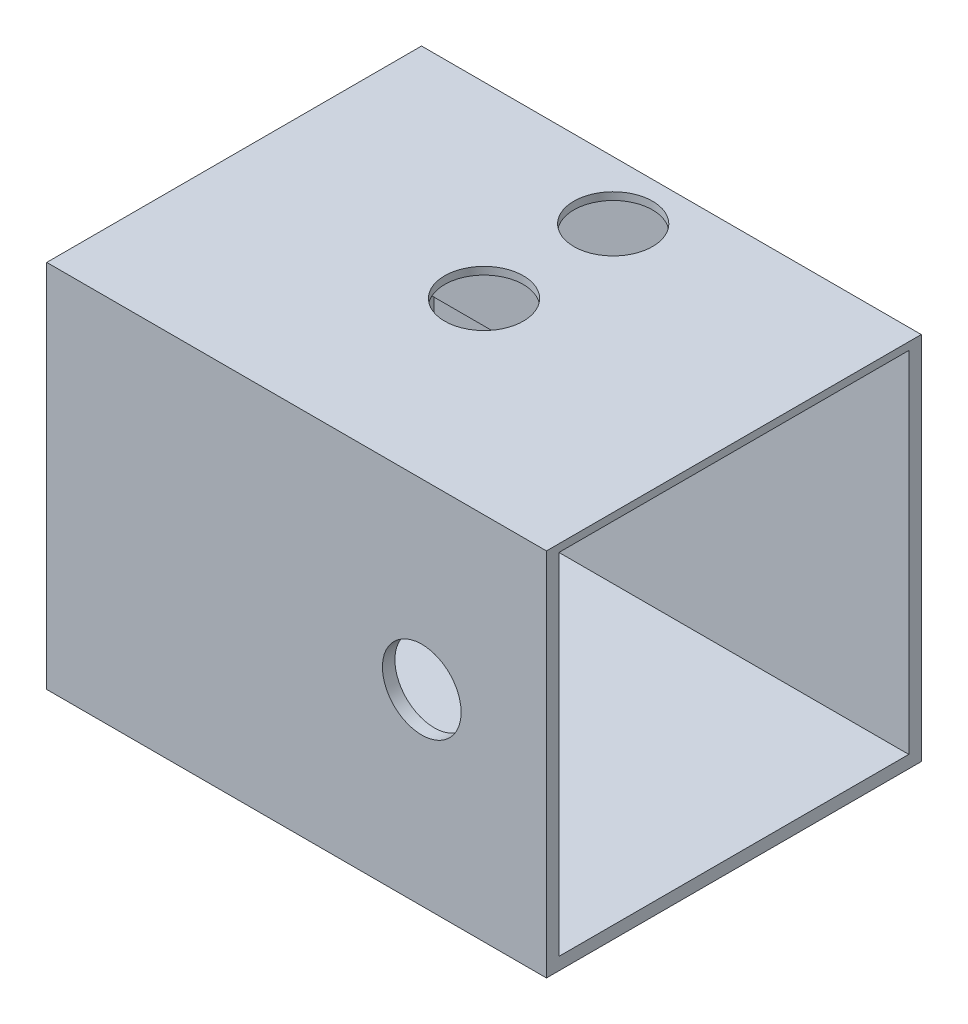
ISO-10303-21;
HEADER;
FILE_DESCRIPTION(('STEP AP214'),'2;1');
FILE_NAME('part.step','',(''),(''),'','','');
FILE_SCHEMA(('AUTOMOTIVE_DESIGN { 1 0 10303 214 1 1 1 1 }'));
ENDSEC;
DATA;
#1=APPLICATION_CONTEXT('core data for automotive mechanical design processes');
#2=APPLICATION_PROTOCOL_DEFINITION('international standard','automotive_design',2000,#1);
#3=PRODUCT_CONTEXT('',#1,'mechanical');
#4=PRODUCT('Part','Part','',(#3));
#5=PRODUCT_RELATED_PRODUCT_CATEGORY('part','',(#4));
#6=PRODUCT_DEFINITION_FORMATION('','',#4);
#7=PRODUCT_DEFINITION_CONTEXT('part definition',#1,'design');
#8=PRODUCT_DEFINITION('design','',#6,#7);
#9=PRODUCT_DEFINITION_SHAPE('','',#8);
#10=(LENGTH_UNIT() NAMED_UNIT(*) SI_UNIT(.MILLI.,.METRE.));
#11=(NAMED_UNIT(*) PLANE_ANGLE_UNIT() SI_UNIT($,.RADIAN.));
#12=(NAMED_UNIT(*) SI_UNIT($,.STERADIAN.) SOLID_ANGLE_UNIT());
#13=UNCERTAINTY_MEASURE_WITH_UNIT(LENGTH_MEASURE(1.E-05),#10,'distance_accuracy_value','');
#14=(GEOMETRIC_REPRESENTATION_CONTEXT(3) GLOBAL_UNCERTAINTY_ASSIGNED_CONTEXT((#13)) GLOBAL_UNIT_ASSIGNED_CONTEXT((#10,
#11,#12)) REPRESENTATION_CONTEXT('',''));
#15=CARTESIAN_POINT('',(0.,0.,0.));
#16=DIRECTION('',(0.,0.,1.));
#17=DIRECTION('',(1.,0.,0.));
#18=AXIS2_PLACEMENT_3D('',#15,#16,#17);
#19=CARTESIAN_POINT('',(25.4,19.05,38.1));
#20=DIRECTION('',(-1.,0.,0.));
#21=DIRECTION('',(0.,-1.,0.));
#22=AXIS2_PLACEMENT_3D('',#19,#20,#21);
#23=PLANE('',#22);
#24=DIRECTION('',(0.,-1.,0.));
#25=VECTOR('',#24,1.);
#26=CARTESIAN_POINT('',(25.4,0.,1.27));
#27=LINE('',#26,#25);
#28=CARTESIAN_POINT('',(25.4,17.78,1.27));
#29=VERTEX_POINT('',#28);
#30=CARTESIAN_POINT('',(25.4,-17.78,1.27));
#31=VERTEX_POINT('',#30);
#32=EDGE_CURVE('E197',#29,#31,#27,.T.);
#33=ORIENTED_EDGE('',*,*,#32,.T.);
#34=DIRECTION('',(0.,0.,-1.));
#35=VECTOR('',#34,1.);
#36=CARTESIAN_POINT('',(25.4,-17.78,0.));
#37=LINE('',#36,#35);
#38=CARTESIAN_POINT('',(25.4,-17.78,36.83));
#39=VERTEX_POINT('',#38);
#40=EDGE_CURVE('E194',#39,#31,#37,.T.);
#41=ORIENTED_EDGE('',*,*,#40,.F.);
#42=DIRECTION('',(0.,-1.,0.));
#43=VECTOR('',#42,1.);
#44=CARTESIAN_POINT('',(25.4,0.,36.83));
#45=LINE('',#44,#43);
#46=CARTESIAN_POINT('',(25.4,17.78,36.83));
#47=VERTEX_POINT('',#46);
#48=EDGE_CURVE('E217',#47,#39,#45,.T.);
#49=ORIENTED_EDGE('',*,*,#48,.F.);
#50=DIRECTION('',(0.,0.,-1.));
#51=VECTOR('',#50,1.);
#52=CARTESIAN_POINT('',(25.4,17.78,0.));
#53=LINE('',#52,#51);
#54=EDGE_CURVE('E230',#47,#29,#53,.T.);
#55=ORIENTED_EDGE('',*,*,#54,.T.);
#56=EDGE_LOOP('',(#33,#41,#49,#55));
#57=FACE_BOUND('',#56,.T.);
#58=DIRECTION('',(0.,0.,-1.));
#59=VECTOR('',#58,1.);
#60=CARTESIAN_POINT('',(25.4,18.55,0.));
#61=LINE('',#60,#59);
#62=CARTESIAN_POINT('',(25.4,18.55,38.1));
#63=VERTEX_POINT('',#62);
#64=CARTESIAN_POINT('',(25.4,18.55,0.));
#65=VERTEX_POINT('',#64);
#66=EDGE_CURVE('E58',#63,#65,#61,.T.);
#67=ORIENTED_EDGE('',*,*,#66,.F.);
#68=DIRECTION('',(0.,1.,0.));
#69=VECTOR('',#68,1.);
#70=CARTESIAN_POINT('',(25.4,19.05,38.1));
#71=LINE('',#70,#69);
#72=CARTESIAN_POINT('',(25.4,-19.05,38.1));
#73=VERTEX_POINT('',#72);
#74=EDGE_CURVE('E173',#73,#63,#71,.T.);
#75=ORIENTED_EDGE('',*,*,#74,.F.);
#76=DIRECTION('',(0.,0.,-1.));
#77=VECTOR('',#76,1.);
#78=CARTESIAN_POINT('',(25.4,-19.05,38.1));
#79=LINE('',#78,#77);
#80=CARTESIAN_POINT('',(25.4,-19.05,0.));
#81=VERTEX_POINT('',#80);
#82=EDGE_CURVE('E50',#73,#81,#79,.T.);
#83=ORIENTED_EDGE('',*,*,#82,.T.);
#84=DIRECTION('',(0.,1.,0.));
#85=VECTOR('',#84,1.);
#86=CARTESIAN_POINT('',(25.4,19.05,0.));
#87=LINE('',#86,#85);
#88=EDGE_CURVE('E184',#81,#65,#87,.T.);
#89=ORIENTED_EDGE('',*,*,#88,.T.);
#90=EDGE_LOOP('',(#67,#75,#83,#89));
#91=FACE_BOUND('',#90,.T.);
#92=ADVANCED_FACE('F42',(#57,#91),#23,.F.);
#93=CARTESIAN_POINT('',(-25.4,19.05,38.1));
#94=DIRECTION('',(1.,0.,0.));
#95=DIRECTION('',(0.,1.,0.));
#96=AXIS2_PLACEMENT_3D('',#93,#94,#95);
#97=PLANE('',#96);
#98=DIRECTION('',(0.,0.,1.));
#99=VECTOR('',#98,1.);
#100=CARTESIAN_POINT('',(-25.4,18.55,0.));
#101=LINE('',#100,#99);
#102=CARTESIAN_POINT('',(-25.4,18.55,0.));
#103=VERTEX_POINT('',#102);
#104=CARTESIAN_POINT('',(-25.4,18.55,38.1));
#105=VERTEX_POINT('',#104);
#106=EDGE_CURVE('E156',#103,#105,#101,.T.);
#107=ORIENTED_EDGE('',*,*,#106,.F.);
#108=DIRECTION('',(0.,-1.,0.));
#109=VECTOR('',#108,1.);
#110=CARTESIAN_POINT('',(-25.4,19.05,0.));
#111=LINE('',#110,#109);
#112=CARTESIAN_POINT('',(-25.4,-19.05,0.));
#113=VERTEX_POINT('',#112);
#114=EDGE_CURVE('E187',#103,#113,#111,.T.);
#115=ORIENTED_EDGE('',*,*,#114,.T.);
#116=DIRECTION('',(0.,0.,-1.));
#117=VECTOR('',#116,1.);
#118=CARTESIAN_POINT('',(-25.4,-19.05,38.1));
#119=LINE('',#118,#117);
#120=CARTESIAN_POINT('',(-25.4,-19.05,38.1));
#121=VERTEX_POINT('',#120);
#122=EDGE_CURVE('E11',#121,#113,#119,.T.);
#123=ORIENTED_EDGE('',*,*,#122,.F.);
#124=DIRECTION('',(0.,-1.,0.));
#125=VECTOR('',#124,1.);
#126=CARTESIAN_POINT('',(-25.4,19.05,38.1));
#127=LINE('',#126,#125);
#128=EDGE_CURVE('E170',#105,#121,#127,.T.);
#129=ORIENTED_EDGE('',*,*,#128,.F.);
#130=EDGE_LOOP('',(#107,#115,#123,#129));
#131=FACE_BOUND('',#130,.T.);
#132=ADVANCED_FACE('F175',(#131),#97,.F.);
#133=CARTESIAN_POINT('',(0.,0.,38.1));
#134=DIRECTION('',(0.,0.,1.));
#135=DIRECTION('',(1.,0.,0.));
#136=AXIS2_PLACEMENT_3D('',#133,#134,#135);
#137=PLANE('',#136);
#138=CARTESIAN_POINT('',(12.7229871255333,0.,38.1));
#139=DIRECTION('',(0.,0.,1.));
#140=DIRECTION('',(1.,0.,0.));
#141=AXIS2_PLACEMENT_3D('',#138,#139,#140);
#142=CIRCLE('',#141,4.);
#143=CARTESIAN_POINT('',(16.7229871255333,0.,38.1));
#144=VERTEX_POINT('',#143);
#145=EDGE_CURVE('E200',#144,#144,#142,.T.);
#146=ORIENTED_EDGE('',*,*,#145,.F.);
#147=EDGE_LOOP('',(#146));
#148=FACE_BOUND('',#147,.T.);
#149=ORIENTED_EDGE('',*,*,#74,.T.);
#150=DIRECTION('',(1.,0.,0.));
#151=VECTOR('',#150,1.);
#152=CARTESIAN_POINT('',(-25.4,18.55,38.1));
#153=LINE('',#152,#151);
#154=EDGE_CURVE('E160',#105,#63,#153,.T.);
#155=ORIENTED_EDGE('',*,*,#154,.F.);
#156=ORIENTED_EDGE('',*,*,#128,.T.);
#157=DIRECTION('',(1.,0.,0.));
#158=VECTOR('',#157,1.);
#159=CARTESIAN_POINT('',(-25.4,-19.05,38.1));
#160=LINE('',#159,#158);
#161=EDGE_CURVE('E177',#121,#73,#160,.T.);
#162=ORIENTED_EDGE('',*,*,#161,.T.);
#163=EDGE_LOOP('',(#149,#155,#156,#162));
#164=FACE_BOUND('',#163,.T.);
#165=ADVANCED_FACE('F169',(#148,#164),#137,.T.);
#166=CARTESIAN_POINT('',(0.,0.,0.));
#167=DIRECTION('',(0.,0.,1.));
#168=DIRECTION('',(1.,0.,0.));
#169=AXIS2_PLACEMENT_3D('',#166,#167,#168);
#170=PLANE('',#169);
#171=ORIENTED_EDGE('',*,*,#114,.F.);
#172=DIRECTION('',(-1.,0.,0.));
#173=VECTOR('',#172,1.);
#174=CARTESIAN_POINT('',(-25.4,18.55,0.));
#175=LINE('',#174,#173);
#176=EDGE_CURVE('E161',#65,#103,#175,.T.);
#177=ORIENTED_EDGE('',*,*,#176,.F.);
#178=ORIENTED_EDGE('',*,*,#88,.F.);
#179=DIRECTION('',(1.,0.,0.));
#180=VECTOR('',#179,1.);
#181=CARTESIAN_POINT('',(-25.4,-19.05,0.));
#182=LINE('',#181,#180);
#183=EDGE_CURVE('E180',#113,#81,#182,.T.);
#184=ORIENTED_EDGE('',*,*,#183,.F.);
#185=EDGE_LOOP('',(#171,#177,#178,#184));
#186=FACE_BOUND('',#185,.T.);
#187=ADVANCED_FACE('F284',(#186),#170,.F.);
#188=CARTESIAN_POINT('',(0.,9.05,19.05));
#189=DIRECTION('',(0.,1.,0.));
#190=DIRECTION('',(0.,0.,1.));
#191=AXIS2_PLACEMENT_3D('',#188,#189,#190);
#192=CYLINDRICAL_SURFACE('',#191,4.);
#193=CARTESIAN_POINT('',(0.,17.78,19.05));
#194=DIRECTION('',(0.,-1.,0.));
#195=DIRECTION('',(1.,0.,0.));
#196=AXIS2_PLACEMENT_3D('',#193,#194,#195);
#197=CIRCLE('',#196,4.);
#198=CARTESIAN_POINT('',(4.,17.78,19.05));
#199=VERTEX_POINT('',#198);
#200=EDGE_CURVE('E192',#199,#199,#197,.T.);
#201=ORIENTED_EDGE('',*,*,#200,.T.);
#202=EDGE_LOOP('',(#201));
#203=FACE_BOUND('',#202,.T.);
#204=CARTESIAN_POINT('',(0.,18.55,19.05));
#205=DIRECTION('',(0.,1.,0.));
#206=DIRECTION('',(0.,0.,1.));
#207=AXIS2_PLACEMENT_3D('',#204,#205,#206);
#208=CIRCLE('',#207,4.);
#209=CARTESIAN_POINT('',(0.,18.55,23.05));
#210=VERTEX_POINT('',#209);
#211=EDGE_CURVE('E357',#210,#210,#208,.F.);
#212=ORIENTED_EDGE('',*,*,#211,.F.);
#213=EDGE_LOOP('',(#212));
#214=FACE_BOUND('',#213,.T.);
#215=ADVANCED_FACE('F290',(#203,#214),#192,.F.);
#216=CARTESIAN_POINT('',(-25.4,-19.05,38.1));
#217=DIRECTION('',(0.,1.,0.));
#218=DIRECTION('',(0.,0.,1.));
#219=AXIS2_PLACEMENT_3D('',#216,#217,#218);
#220=PLANE('',#219);
#221=ORIENTED_EDGE('',*,*,#183,.T.);
#222=ORIENTED_EDGE('',*,*,#82,.F.);
#223=ORIENTED_EDGE('',*,*,#161,.F.);
#224=ORIENTED_EDGE('',*,*,#122,.T.);
#225=EDGE_LOOP('',(#221,#222,#223,#224));
#226=FACE_BOUND('',#225,.T.);
#227=ADVANCED_FACE('F274',(#226),#220,.F.);
#228=CARTESIAN_POINT('',(-22.86,-17.78,0.));
#229=DIRECTION('',(0.,-1.,0.));
#230=DIRECTION('',(1.,0.,0.));
#231=AXIS2_PLACEMENT_3D('',#228,#229,#230);
#232=PLANE('',#231);
#233=ORIENTED_EDGE('',*,*,#40,.T.);
#234=DIRECTION('',(1.,0.,0.));
#235=VECTOR('',#234,1.);
#236=CARTESIAN_POINT('',(-22.86,-17.78,1.27));
#237=LINE('',#236,#235);
#238=CARTESIAN_POINT('',(-22.86,-17.78,1.27));
#239=VERTEX_POINT('',#238);
#240=EDGE_CURVE('E226',#239,#31,#237,.T.);
#241=ORIENTED_EDGE('',*,*,#240,.F.);
#242=DIRECTION('',(0.,0.,-1.));
#243=VECTOR('',#242,1.);
#244=CARTESIAN_POINT('',(-22.86,-17.78,0.));
#245=LINE('',#244,#243);
#246=CARTESIAN_POINT('',(-22.86,-17.78,36.83));
#247=VERTEX_POINT('',#246);
#248=EDGE_CURVE('E213',#247,#239,#245,.T.);
#249=ORIENTED_EDGE('',*,*,#248,.F.);
#250=DIRECTION('',(1.,0.,0.));
#251=VECTOR('',#250,1.);
#252=CARTESIAN_POINT('',(-22.86,-17.78,36.83));
#253=LINE('',#252,#251);
#254=EDGE_CURVE('E188',#247,#39,#253,.T.);
#255=ORIENTED_EDGE('',*,*,#254,.T.);
#256=EDGE_LOOP('',(#233,#241,#249,#255));
#257=FACE_BOUND('',#256,.T.);
#258=ADVANCED_FACE('F263',(#257),#232,.F.);
#259=CARTESIAN_POINT('',(-22.86,0.,36.83));
#260=DIRECTION('',(0.,0.,1.));
#261=DIRECTION('',(0.,-1.,0.));
#262=AXIS2_PLACEMENT_3D('',#259,#260,#261);
#263=PLANE('',#262);
#264=CARTESIAN_POINT('',(12.7229871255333,0.,36.83));
#265=DIRECTION('',(0.,0.,1.));
#266=DIRECTION('',(0.,-1.,0.));
#267=AXIS2_PLACEMENT_3D('',#264,#265,#266);
#268=CIRCLE('',#267,4.);
#269=CARTESIAN_POINT('',(12.7229871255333,-4.,36.83));
#270=VERTEX_POINT('',#269);
#271=EDGE_CURVE('E45',#270,#270,#268,.T.);
#272=ORIENTED_EDGE('',*,*,#271,.T.);
#273=EDGE_LOOP('',(#272));
#274=FACE_BOUND('',#273,.T.);
#275=ORIENTED_EDGE('',*,*,#48,.T.);
#276=ORIENTED_EDGE('',*,*,#254,.F.);
#277=DIRECTION('',(0.,-1.,0.));
#278=VECTOR('',#277,1.);
#279=CARTESIAN_POINT('',(-22.86,0.,36.83));
#280=LINE('',#279,#278);
#281=CARTESIAN_POINT('',(-22.86,17.78,36.83));
#282=VERTEX_POINT('',#281);
#283=EDGE_CURVE('E223',#282,#247,#280,.T.);
#284=ORIENTED_EDGE('',*,*,#283,.F.);
#285=DIRECTION('',(1.,0.,0.));
#286=VECTOR('',#285,1.);
#287=CARTESIAN_POINT('',(-22.86,17.78,36.83));
#288=LINE('',#287,#286);
#289=EDGE_CURVE('E236',#282,#47,#288,.T.);
#290=ORIENTED_EDGE('',*,*,#289,.T.);
#291=EDGE_LOOP('',(#275,#276,#284,#290));
#292=FACE_BOUND('',#291,.T.);
#293=ADVANCED_FACE('F265',(#274,#292),#263,.F.);
#294=CARTESIAN_POINT('',(-22.86,17.78,0.));
#295=DIRECTION('',(0.,-1.,0.));
#296=DIRECTION('',(1.,0.,0.));
#297=AXIS2_PLACEMENT_3D('',#294,#295,#296);
#298=PLANE('',#297);
#299=CARTESIAN_POINT('',(0.,17.78,5.91570941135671));
#300=DIRECTION('',(0.,-1.,0.));
#301=DIRECTION('',(1.,0.,0.));
#302=AXIS2_PLACEMENT_3D('',#299,#300,#301);
#303=CIRCLE('',#302,4.);
#304=CARTESIAN_POINT('',(4.,17.78,5.91570941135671));
#305=VERTEX_POINT('',#304);
#306=EDGE_CURVE('E165',#305,#305,#303,.T.);
#307=ORIENTED_EDGE('',*,*,#306,.F.);
#308=EDGE_LOOP('',(#307));
#309=FACE_BOUND('',#308,.T.);
#310=DIRECTION('',(1.,0.,0.));
#311=VECTOR('',#310,1.);
#312=CARTESIAN_POINT('',(-22.86,17.78,1.27));
#313=LINE('',#312,#311);
#314=CARTESIAN_POINT('',(-22.86,17.78,1.27));
#315=VERTEX_POINT('',#314);
#316=EDGE_CURVE('E238',#315,#29,#313,.T.);
#317=ORIENTED_EDGE('',*,*,#316,.T.);
#318=ORIENTED_EDGE('',*,*,#54,.F.);
#319=ORIENTED_EDGE('',*,*,#289,.F.);
#320=DIRECTION('',(0.,0.,-1.));
#321=VECTOR('',#320,1.);
#322=CARTESIAN_POINT('',(-22.86,17.78,0.));
#323=LINE('',#322,#321);
#324=CARTESIAN_POINT('',(-22.86,17.78,25.8973004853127));
#325=VERTEX_POINT('',#324);
#326=EDGE_CURVE('E220',#282,#325,#323,.T.);
#327=ORIENTED_EDGE('',*,*,#326,.T.);
#328=DIRECTION('',(-1.,0.,0.));
#329=VECTOR('',#328,1.);
#330=CARTESIAN_POINT('',(19.14,17.78,25.8973004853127));
#331=LINE('',#330,#329);
#332=CARTESIAN_POINT('',(19.14,17.78,25.8973004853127));
#333=VERTEX_POINT('',#332);
#334=EDGE_CURVE('E66',#333,#325,#331,.T.);
#335=ORIENTED_EDGE('',*,*,#334,.F.);
#336=DIRECTION('',(0.,0.,1.));
#337=VECTOR('',#336,1.);
#338=CARTESIAN_POINT('',(19.14,17.78,23.8973004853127));
#339=LINE('',#338,#337);
#340=CARTESIAN_POINT('',(19.14,17.78,23.8973004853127));
#341=VERTEX_POINT('',#340);
#342=EDGE_CURVE('E380',#341,#333,#339,.T.);
#343=ORIENTED_EDGE('',*,*,#342,.F.);
#344=DIRECTION('',(-1.,0.,0.));
#345=VECTOR('',#344,1.);
#346=CARTESIAN_POINT('',(19.14,17.78,23.8973004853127));
#347=LINE('',#346,#345);
#348=CARTESIAN_POINT('',(-22.86,17.78,23.8973004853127));
#349=VERTEX_POINT('',#348);
#350=EDGE_CURVE('E365',#341,#349,#347,.T.);
#351=ORIENTED_EDGE('',*,*,#350,.T.);
#352=CARTESIAN_POINT('',(-22.86,17.78,14.701982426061));
#353=VERTEX_POINT('',#352);
#354=EDGE_CURVE('E224',#349,#353,#323,.T.);
#355=ORIENTED_EDGE('',*,*,#354,.T.);
#356=DIRECTION('',(-1.,0.,0.));
#357=VECTOR('',#356,1.);
#358=CARTESIAN_POINT('',(19.14,17.78,14.701982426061));
#359=LINE('',#358,#357);
#360=CARTESIAN_POINT('',(19.14,17.78,14.701982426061));
#361=VERTEX_POINT('',#360);
#362=EDGE_CURVE('E209',#361,#353,#359,.T.);
#363=ORIENTED_EDGE('',*,*,#362,.F.);
#364=DIRECTION('',(0.,0.,1.));
#365=VECTOR('',#364,1.);
#366=CARTESIAN_POINT('',(19.14,17.78,0.));
#367=LINE('',#366,#365);
#368=CARTESIAN_POINT('',(19.14,17.78,12.701982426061));
#369=VERTEX_POINT('',#368);
#370=EDGE_CURVE('E389',#369,#361,#367,.T.);
#371=ORIENTED_EDGE('',*,*,#370,.F.);
#372=DIRECTION('',(-1.,0.,0.));
#373=VECTOR('',#372,1.);
#374=CARTESIAN_POINT('',(19.14,17.78,12.701982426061));
#375=LINE('',#374,#373);
#376=CARTESIAN_POINT('',(-22.86,17.78,12.701982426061));
#377=VERTEX_POINT('',#376);
#378=EDGE_CURVE('E204',#369,#377,#375,.T.);
#379=ORIENTED_EDGE('',*,*,#378,.T.);
#380=EDGE_CURVE('E219',#377,#315,#323,.T.);
#381=ORIENTED_EDGE('',*,*,#380,.T.);
#382=EDGE_LOOP('',(#317,#318,#319,#327,#335,#343,#351,#355,#363,#371,#379,#381));
#383=FACE_BOUND('',#382,.T.);
#384=ORIENTED_EDGE('',*,*,#200,.F.);
#385=EDGE_LOOP('',(#384));
#386=FACE_BOUND('',#385,.T.);
#387=ADVANCED_FACE('F254',(#309,#383,#386),#298,.T.);
#388=CARTESIAN_POINT('',(-22.86,0.,1.27));
#389=DIRECTION('',(0.,0.,1.));
#390=DIRECTION('',(0.,-1.,0.));
#391=AXIS2_PLACEMENT_3D('',#388,#389,#390);
#392=PLANE('',#391);
#393=ORIENTED_EDGE('',*,*,#32,.F.);
#394=ORIENTED_EDGE('',*,*,#316,.F.);
#395=DIRECTION('',(0.,-1.,0.));
#396=VECTOR('',#395,1.);
#397=CARTESIAN_POINT('',(-22.86,0.,1.27));
#398=LINE('',#397,#396);
#399=EDGE_CURVE('E216',#315,#239,#398,.T.);
#400=ORIENTED_EDGE('',*,*,#399,.T.);
#401=ORIENTED_EDGE('',*,*,#240,.T.);
#402=EDGE_LOOP('',(#393,#394,#400,#401));
#403=FACE_BOUND('',#402,.T.);
#404=ADVANCED_FACE('F243',(#403),#392,.T.);
#405=CARTESIAN_POINT('',(-22.86,0.,0.));
#406=DIRECTION('',(1.,0.,0.));
#407=DIRECTION('',(0.,1.,0.));
#408=AXIS2_PLACEMENT_3D('',#405,#406,#407);
#409=PLANE('',#408);
#410=DIRECTION('',(0.,-1.,0.));
#411=VECTOR('',#410,1.);
#412=CARTESIAN_POINT('',(-22.86,17.78,23.8973004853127));
#413=LINE('',#412,#411);
#414=CARTESIAN_POINT('',(-22.86,11.6248966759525,23.8973004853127));
#415=VERTEX_POINT('',#414);
#416=EDGE_CURVE('E369',#349,#415,#413,.T.);
#417=ORIENTED_EDGE('',*,*,#416,.T.);
#418=DIRECTION('',(0.,0.,1.));
#419=VECTOR('',#418,1.);
#420=CARTESIAN_POINT('',(-22.86,11.6248966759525,23.8973004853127));
#421=LINE('',#420,#419);
#422=CARTESIAN_POINT('',(-22.86,11.6248966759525,25.8973004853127));
#423=VERTEX_POINT('',#422);
#424=EDGE_CURVE('E374',#415,#423,#421,.T.);
#425=ORIENTED_EDGE('',*,*,#424,.T.);
#426=DIRECTION('',(0.,-1.,0.));
#427=VECTOR('',#426,1.);
#428=CARTESIAN_POINT('',(-22.86,17.78,25.8973004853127));
#429=LINE('',#428,#427);
#430=EDGE_CURVE('E371',#325,#423,#429,.T.);
#431=ORIENTED_EDGE('',*,*,#430,.F.);
#432=ORIENTED_EDGE('',*,*,#326,.F.);
#433=ORIENTED_EDGE('',*,*,#283,.T.);
#434=ORIENTED_EDGE('',*,*,#248,.T.);
#435=ORIENTED_EDGE('',*,*,#399,.F.);
#436=ORIENTED_EDGE('',*,*,#380,.F.);
#437=DIRECTION('',(0.,-1.,0.));
#438=VECTOR('',#437,1.);
#439=CARTESIAN_POINT('',(-22.86,0.,12.701982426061));
#440=LINE('',#439,#438);
#441=CARTESIAN_POINT('',(-22.86,11.78,12.701982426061));
#442=VERTEX_POINT('',#441);
#443=EDGE_CURVE('E377',#377,#442,#440,.T.);
#444=ORIENTED_EDGE('',*,*,#443,.T.);
#445=DIRECTION('',(0.,0.,-1.));
#446=VECTOR('',#445,1.);
#447=CARTESIAN_POINT('',(-22.86,11.78,0.));
#448=LINE('',#447,#446);
#449=CARTESIAN_POINT('',(-22.86,11.78,14.701982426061));
#450=VERTEX_POINT('',#449);
#451=EDGE_CURVE('E390',#450,#442,#448,.T.);
#452=ORIENTED_EDGE('',*,*,#451,.F.);
#453=DIRECTION('',(0.,-1.,0.));
#454=VECTOR('',#453,1.);
#455=CARTESIAN_POINT('',(-22.86,0.,14.701982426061));
#456=LINE('',#455,#454);
#457=EDGE_CURVE('E398',#353,#450,#456,.T.);
#458=ORIENTED_EDGE('',*,*,#457,.F.);
#459=ORIENTED_EDGE('',*,*,#354,.F.);
#460=EDGE_LOOP('',(#417,#425,#431,#432,#433,#434,#435,#436,#444,#452,#458,#459));
#461=FACE_BOUND('',#460,.T.);
#462=ADVANCED_FACE('F260',(#461),#409,.T.);
#463=CARTESIAN_POINT('',(12.7229871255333,0.,28.1));
#464=DIRECTION('',(0.,0.,1.));
#465=DIRECTION('',(1.,0.,0.));
#466=AXIS2_PLACEMENT_3D('',#463,#464,#465);
#467=CYLINDRICAL_SURFACE('',#466,4.);
#468=ORIENTED_EDGE('',*,*,#145,.T.);
#469=EDGE_LOOP('',(#468));
#470=FACE_BOUND('',#469,.T.);
#471=ORIENTED_EDGE('',*,*,#271,.F.);
#472=EDGE_LOOP('',(#471));
#473=FACE_BOUND('',#472,.T.);
#474=ADVANCED_FACE('F299',(#470,#473),#467,.F.);
#475=CARTESIAN_POINT('',(19.14,0.,12.701982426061));
#476=DIRECTION('',(0.,0.,-1.));
#477=DIRECTION('',(-1.,0.,0.));
#478=AXIS2_PLACEMENT_3D('',#475,#476,#477);
#479=PLANE('',#478);
#480=ORIENTED_EDGE('',*,*,#443,.F.);
#481=ORIENTED_EDGE('',*,*,#378,.F.);
#482=DIRECTION('',(0.,-1.,0.));
#483=VECTOR('',#482,1.);
#484=CARTESIAN_POINT('',(19.14,0.,12.701982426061));
#485=LINE('',#484,#483);
#486=CARTESIAN_POINT('',(19.14,11.78,12.701982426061));
#487=VERTEX_POINT('',#486);
#488=EDGE_CURVE('E386',#369,#487,#485,.T.);
#489=ORIENTED_EDGE('',*,*,#488,.T.);
#490=DIRECTION('',(-1.,0.,0.));
#491=VECTOR('',#490,1.);
#492=CARTESIAN_POINT('',(19.14,11.78,12.701982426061));
#493=LINE('',#492,#491);
#494=EDGE_CURVE('E396',#487,#442,#493,.T.);
#495=ORIENTED_EDGE('',*,*,#494,.T.);
#496=EDGE_LOOP('',(#480,#481,#489,#495));
#497=FACE_BOUND('',#496,.T.);
#498=ADVANCED_FACE('F303',(#497),#479,.T.);
#499=CARTESIAN_POINT('',(19.14,0.,14.701982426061));
#500=DIRECTION('',(0.,0.,-1.));
#501=DIRECTION('',(-1.,0.,0.));
#502=AXIS2_PLACEMENT_3D('',#499,#500,#501);
#503=PLANE('',#502);
#504=ORIENTED_EDGE('',*,*,#457,.T.);
#505=DIRECTION('',(-1.,0.,0.));
#506=VECTOR('',#505,1.);
#507=CARTESIAN_POINT('',(19.14,11.78,14.701982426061));
#508=LINE('',#507,#506);
#509=CARTESIAN_POINT('',(19.14,11.78,14.701982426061));
#510=VERTEX_POINT('',#509);
#511=EDGE_CURVE('E404',#510,#450,#508,.T.);
#512=ORIENTED_EDGE('',*,*,#511,.F.);
#513=DIRECTION('',(0.,-1.,0.));
#514=VECTOR('',#513,1.);
#515=CARTESIAN_POINT('',(19.14,0.,14.701982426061));
#516=LINE('',#515,#514);
#517=EDGE_CURVE('E392',#361,#510,#516,.T.);
#518=ORIENTED_EDGE('',*,*,#517,.F.);
#519=ORIENTED_EDGE('',*,*,#362,.T.);
#520=EDGE_LOOP('',(#504,#512,#518,#519));
#521=FACE_BOUND('',#520,.T.);
#522=ADVANCED_FACE('F310',(#521),#503,.F.);
#523=CARTESIAN_POINT('',(19.14,11.78,0.));
#524=DIRECTION('',(0.,1.,0.));
#525=DIRECTION('',(-1.,0.,0.));
#526=AXIS2_PLACEMENT_3D('',#523,#524,#525);
#527=PLANE('',#526);
#528=ORIENTED_EDGE('',*,*,#451,.T.);
#529=ORIENTED_EDGE('',*,*,#494,.F.);
#530=DIRECTION('',(0.,0.,-1.));
#531=VECTOR('',#530,1.);
#532=CARTESIAN_POINT('',(19.14,11.78,0.));
#533=LINE('',#532,#531);
#534=EDGE_CURVE('E394',#510,#487,#533,.T.);
#535=ORIENTED_EDGE('',*,*,#534,.F.);
#536=ORIENTED_EDGE('',*,*,#511,.T.);
#537=EDGE_LOOP('',(#528,#529,#535,#536));
#538=FACE_BOUND('',#537,.T.);
#539=ADVANCED_FACE('F314',(#538),#527,.F.);
#540=CARTESIAN_POINT('',(19.14,0.,0.));
#541=DIRECTION('',(1.,0.,0.));
#542=DIRECTION('',(0.,1.,0.));
#543=AXIS2_PLACEMENT_3D('',#540,#541,#542);
#544=PLANE('',#543);
#545=ORIENTED_EDGE('',*,*,#488,.F.);
#546=ORIENTED_EDGE('',*,*,#370,.T.);
#547=ORIENTED_EDGE('',*,*,#517,.T.);
#548=ORIENTED_EDGE('',*,*,#534,.T.);
#549=EDGE_LOOP('',(#545,#546,#547,#548));
#550=FACE_BOUND('',#549,.T.);
#551=ADVANCED_FACE('F318',(#550),#544,.T.);
#552=CARTESIAN_POINT('',(19.14,11.6248966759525,23.8973004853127));
#553=DIRECTION('',(0.,-1.,0.));
#554=DIRECTION('',(1.,0.,0.));
#555=AXIS2_PLACEMENT_3D('',#552,#553,#554);
#556=PLANE('',#555);
#557=ORIENTED_EDGE('',*,*,#424,.F.);
#558=DIRECTION('',(-1.,0.,0.));
#559=VECTOR('',#558,1.);
#560=CARTESIAN_POINT('',(19.14,11.6248966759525,23.8973004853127));
#561=LINE('',#560,#559);
#562=CARTESIAN_POINT('',(19.14,11.6248966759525,23.8973004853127));
#563=VERTEX_POINT('',#562);
#564=EDGE_CURVE('E360',#563,#415,#561,.T.);
#565=ORIENTED_EDGE('',*,*,#564,.F.);
#566=DIRECTION('',(0.,0.,1.));
#567=VECTOR('',#566,1.);
#568=CARTESIAN_POINT('',(19.14,11.6248966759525,23.8973004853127));
#569=LINE('',#568,#567);
#570=CARTESIAN_POINT('',(19.14,11.6248966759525,25.8973004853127));
#571=VERTEX_POINT('',#570);
#572=EDGE_CURVE('E372',#563,#571,#569,.T.);
#573=ORIENTED_EDGE('',*,*,#572,.T.);
#574=DIRECTION('',(-1.,0.,0.));
#575=VECTOR('',#574,1.);
#576=CARTESIAN_POINT('',(19.14,11.6248966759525,25.8973004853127));
#577=LINE('',#576,#575);
#578=EDGE_CURVE('E361',#571,#423,#577,.T.);
#579=ORIENTED_EDGE('',*,*,#578,.T.);
#580=EDGE_LOOP('',(#557,#565,#573,#579));
#581=FACE_BOUND('',#580,.T.);
#582=ADVANCED_FACE('F322',(#581),#556,.T.);
#583=CARTESIAN_POINT('',(19.14,17.78,23.8973004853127));
#584=DIRECTION('',(0.,0.,-1.));
#585=DIRECTION('',(-1.,0.,0.));
#586=AXIS2_PLACEMENT_3D('',#583,#584,#585);
#587=PLANE('',#586);
#588=ORIENTED_EDGE('',*,*,#416,.F.);
#589=ORIENTED_EDGE('',*,*,#350,.F.);
#590=DIRECTION('',(0.,-1.,0.));
#591=VECTOR('',#590,1.);
#592=CARTESIAN_POINT('',(19.14,17.78,23.8973004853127));
#593=LINE('',#592,#591);
#594=EDGE_CURVE('E363',#341,#563,#593,.T.);
#595=ORIENTED_EDGE('',*,*,#594,.T.);
#596=ORIENTED_EDGE('',*,*,#564,.T.);
#597=EDGE_LOOP('',(#588,#589,#595,#596));
#598=FACE_BOUND('',#597,.T.);
#599=ADVANCED_FACE('F329',(#598),#587,.T.);
#600=CARTESIAN_POINT('',(19.14,17.78,25.8973004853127));
#601=DIRECTION('',(0.,0.,-1.));
#602=DIRECTION('',(-1.,0.,0.));
#603=AXIS2_PLACEMENT_3D('',#600,#601,#602);
#604=PLANE('',#603);
#605=ORIENTED_EDGE('',*,*,#430,.T.);
#606=ORIENTED_EDGE('',*,*,#578,.F.);
#607=DIRECTION('',(0.,-1.,0.));
#608=VECTOR('',#607,1.);
#609=CARTESIAN_POINT('',(19.14,17.78,25.8973004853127));
#610=LINE('',#609,#608);
#611=EDGE_CURVE('E382',#333,#571,#610,.T.);
#612=ORIENTED_EDGE('',*,*,#611,.F.);
#613=ORIENTED_EDGE('',*,*,#334,.T.);
#614=EDGE_LOOP('',(#605,#606,#612,#613));
#615=FACE_BOUND('',#614,.T.);
#616=ADVANCED_FACE('F327',(#615),#604,.F.);
#617=CARTESIAN_POINT('',(19.14,0.,0.));
#618=DIRECTION('',(1.,0.,0.));
#619=DIRECTION('',(0.,0.,-1.));
#620=AXIS2_PLACEMENT_3D('',#617,#618,#619);
#621=PLANE('',#620);
#622=ORIENTED_EDGE('',*,*,#572,.F.);
#623=ORIENTED_EDGE('',*,*,#594,.F.);
#624=ORIENTED_EDGE('',*,*,#342,.T.);
#625=ORIENTED_EDGE('',*,*,#611,.T.);
#626=EDGE_LOOP('',(#622,#623,#624,#625));
#627=FACE_BOUND('',#626,.T.);
#628=ADVANCED_FACE('F324',(#627),#621,.T.);
#629=CARTESIAN_POINT('',(0.,18.55,0.));
#630=DIRECTION('',(0.,1.,0.));
#631=DIRECTION('',(0.,0.,1.));
#632=AXIS2_PLACEMENT_3D('',#629,#630,#631);
#633=PLANE('',#632);
#634=CARTESIAN_POINT('',(0.,18.55,5.91570941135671));
#635=DIRECTION('',(0.,1.,0.));
#636=DIRECTION('',(0.,0.,1.));
#637=AXIS2_PLACEMENT_3D('',#634,#635,#636);
#638=CIRCLE('',#637,4.);
#639=CARTESIAN_POINT('',(0.,18.55,9.9157094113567));
#640=VERTEX_POINT('',#639);
#641=EDGE_CURVE('E351',#640,#640,#638,.T.);
#642=ORIENTED_EDGE('',*,*,#641,.F.);
#643=EDGE_LOOP('',(#642));
#644=FACE_BOUND('',#643,.T.);
#645=ORIENTED_EDGE('',*,*,#176,.T.);
#646=ORIENTED_EDGE('',*,*,#106,.T.);
#647=ORIENTED_EDGE('',*,*,#154,.T.);
#648=ORIENTED_EDGE('',*,*,#66,.T.);
#649=EDGE_LOOP('',(#645,#646,#647,#648));
#650=FACE_BOUND('',#649,.T.);
#651=ORIENTED_EDGE('',*,*,#211,.T.);
#652=EDGE_LOOP('',(#651));
#653=FACE_BOUND('',#652,.T.);
#654=ADVANCED_FACE('F158',(#644,#650,#653),#633,.T.);
#655=CARTESIAN_POINT('',(0.,1.05,5.91570941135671));
#656=DIRECTION('',(0.,1.,0.));
#657=DIRECTION('',(0.,0.,1.));
#658=AXIS2_PLACEMENT_3D('',#655,#656,#657);
#659=CYLINDRICAL_SURFACE('',#658,4.);
#660=ORIENTED_EDGE('',*,*,#306,.T.);
#661=EDGE_LOOP('',(#660));
#662=FACE_BOUND('',#661,.T.);
#663=ORIENTED_EDGE('',*,*,#641,.T.);
#664=EDGE_LOOP('',(#663));
#665=FACE_BOUND('',#664,.T.);
#666=ADVANCED_FACE('F340',(#662,#665),#659,.F.);
#667=CLOSED_SHELL('',(#92,#132,#165,#187,#215,#227,#258,#293,#387,#404,#462,#474,#498,#522,#539,
#551,#582,#599,#616,#628,#654,#666));
#668=MANIFOLD_SOLID_BREP('B2',#667);
#669=ADVANCED_BREP_SHAPE_REPRESENTATION('',(#18,#668),#14);
#670=SHAPE_DEFINITION_REPRESENTATION(#9,#669);
ENDSEC;
END-ISO-10303-21;
